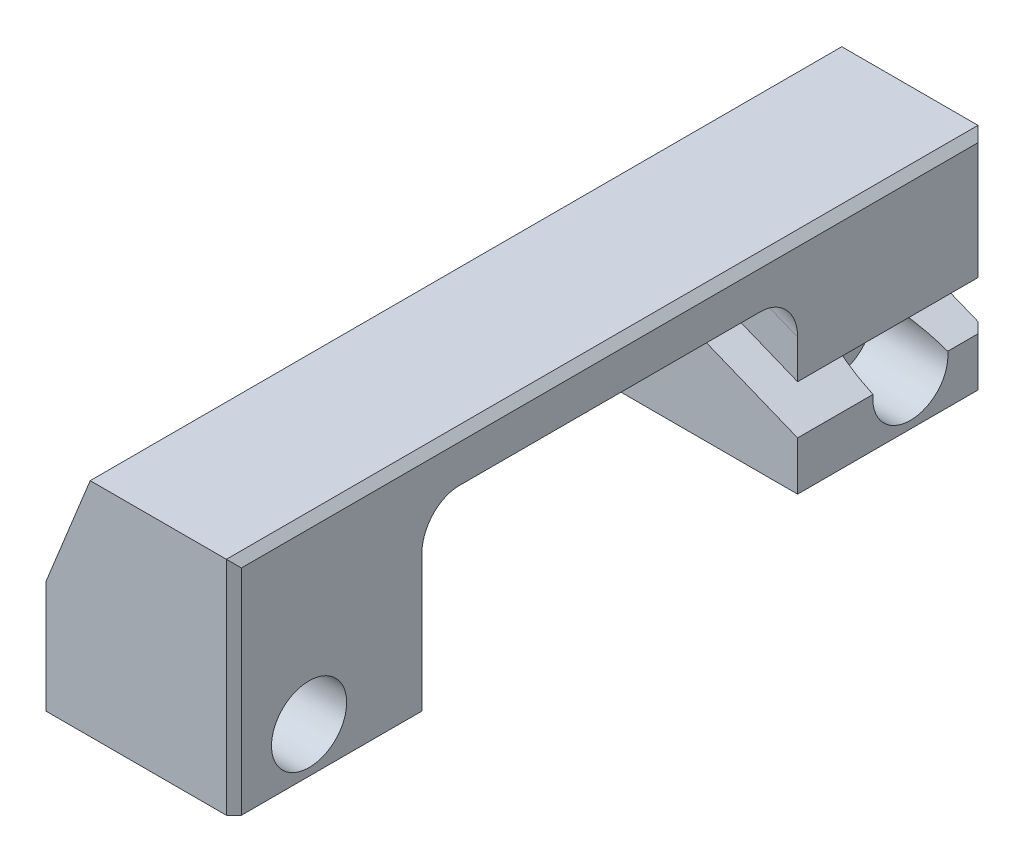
ISO-10303-21;
HEADER;
FILE_DESCRIPTION(('STEP AP214'),'2;1');
FILE_NAME('part.step','',(''),(''),'','','');
FILE_SCHEMA(('AUTOMOTIVE_DESIGN { 1 0 10303 214 1 1 1 1 }'));
ENDSEC;
DATA;
#1=APPLICATION_CONTEXT('core data for automotive mechanical design processes');
#2=APPLICATION_PROTOCOL_DEFINITION('international standard','automotive_design',2000,#1);
#3=PRODUCT_CONTEXT('',#1,'mechanical');
#4=PRODUCT('Part','Part','',(#3));
#5=PRODUCT_RELATED_PRODUCT_CATEGORY('part','',(#4));
#6=PRODUCT_DEFINITION_FORMATION('','',#4);
#7=PRODUCT_DEFINITION_CONTEXT('part definition',#1,'design');
#8=PRODUCT_DEFINITION('design','',#6,#7);
#9=PRODUCT_DEFINITION_SHAPE('','',#8);
#10=(LENGTH_UNIT() NAMED_UNIT(*) SI_UNIT(.MILLI.,.METRE.));
#11=(NAMED_UNIT(*) PLANE_ANGLE_UNIT() SI_UNIT($,.RADIAN.));
#12=(NAMED_UNIT(*) SI_UNIT($,.STERADIAN.) SOLID_ANGLE_UNIT());
#13=UNCERTAINTY_MEASURE_WITH_UNIT(LENGTH_MEASURE(1.E-05),#10,'distance_accuracy_value','');
#14=(GEOMETRIC_REPRESENTATION_CONTEXT(3) GLOBAL_UNCERTAINTY_ASSIGNED_CONTEXT((#13)) GLOBAL_UNIT_ASSIGNED_CONTEXT((#10,
#11,#12)) REPRESENTATION_CONTEXT('',''));
#15=CARTESIAN_POINT('',(0.,0.,0.));
#16=DIRECTION('',(0.,0.,1.));
#17=DIRECTION('',(1.,0.,0.));
#18=AXIS2_PLACEMENT_3D('',#15,#16,#17);
#19=CARTESIAN_POINT('',(0.,0.,50.));
#20=DIRECTION('',(0.,1.,0.));
#21=DIRECTION('',(0.,0.,1.));
#22=AXIS2_PLACEMENT_3D('',#19,#20,#21);
#23=PLANE('',#22);
#24=DIRECTION('',(1.,0.,0.));
#25=VECTOR('',#24,1.);
#26=CARTESIAN_POINT('',(0.,0.,50.));
#27=LINE('',#26,#25);
#28=CARTESIAN_POINT('',(7.00000000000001,0.,50.));
#29=VERTEX_POINT('',#28);
#30=CARTESIAN_POINT('',(31.,0.,50.));
#31=VERTEX_POINT('',#30);
#32=EDGE_CURVE('E509',#29,#31,#27,.T.);
#33=ORIENTED_EDGE('',*,*,#32,.F.);
#34=DIRECTION('',(0.,0.,1.));
#35=VECTOR('',#34,1.);
#36=CARTESIAN_POINT('',(7.,0.,-50.));
#37=LINE('',#36,#35);
#38=CARTESIAN_POINT('',(7.00000000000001,0.,25.));
#39=VERTEX_POINT('',#38);
#40=EDGE_CURVE('E494',#39,#29,#37,.T.);
#41=ORIENTED_EDGE('',*,*,#40,.F.);
#42=DIRECTION('',(1.,0.,0.));
#43=VECTOR('',#42,1.);
#44=CARTESIAN_POINT('',(6.35241145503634,0.,25.));
#45=LINE('',#44,#43);
#46=CARTESIAN_POINT('',(32.,0.,25.));
#47=VERTEX_POINT('',#46);
#48=EDGE_CURVE('E665',#39,#47,#45,.T.);
#49=ORIENTED_EDGE('',*,*,#48,.T.);
#50=DIRECTION('',(0.,0.,-1.));
#51=VECTOR('',#50,1.);
#52=CARTESIAN_POINT('',(32.,0.,50.));
#53=LINE('',#52,#51);
#54=CARTESIAN_POINT('',(32.,0.,49.));
#55=VERTEX_POINT('',#54);
#56=EDGE_CURVE('E531',#55,#47,#53,.T.);
#57=ORIENTED_EDGE('',*,*,#56,.F.);
#58=DIRECTION('',(0.707106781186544,0.,-0.707106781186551));
#59=VECTOR('',#58,1.);
#60=CARTESIAN_POINT('',(31.,0.,50.));
#61=LINE('',#60,#59);
#62=EDGE_CURVE('E516',#55,#31,#61,.F.);
#63=ORIENTED_EDGE('',*,*,#62,.T.);
#64=EDGE_LOOP('',(#33,#41,#49,#57,#63));
#65=FACE_BOUND('',#64,.T.);
#66=ADVANCED_FACE('F348',(#65),#23,.F.);
#67=CARTESIAN_POINT('',(32.,0.,50.));
#68=DIRECTION('',(-1.,0.,0.));
#69=DIRECTION('',(0.,0.,1.));
#70=AXIS2_PLACEMENT_3D('',#67,#68,#69);
#71=PLANE('',#70);
#72=CARTESIAN_POINT('',(32.,0.,-25.));
#73=VERTEX_POINT('',#72);
#74=CARTESIAN_POINT('',(32.,0.,-49.));
#75=VERTEX_POINT('',#74);
#76=EDGE_CURVE('E530',#73,#75,#53,.T.);
#77=ORIENTED_EDGE('',*,*,#76,.T.);
#78=DIRECTION('',(0.,1.,0.));
#79=VECTOR('',#78,1.);
#80=CARTESIAN_POINT('',(32.,6.48478614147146,-49.));
#81=LINE('',#80,#79);
#82=CARTESIAN_POINT('',(32.,6.48478614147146,-49.));
#83=VERTEX_POINT('',#82);
#84=EDGE_CURVE('E568',#75,#83,#81,.T.);
#85=ORIENTED_EDGE('',*,*,#84,.T.);
#86=DIRECTION('',(0.,0.,1.));
#87=VECTOR('',#86,1.);
#88=CARTESIAN_POINT('',(32.,6.48478614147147,-50.));
#89=LINE('',#88,#87);
#90=CARTESIAN_POINT('',(32.,6.48478614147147,-44.9764427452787));
#91=VERTEX_POINT('',#90);
#92=EDGE_CURVE('E690',#83,#91,#89,.T.);
#93=ORIENTED_EDGE('',*,*,#92,.T.);
#94=CARTESIAN_POINT('',(32.,6.,-40.));
#95=DIRECTION('',(1.,0.,0.));
#96=DIRECTION('',(0.,0.,-1.));
#97=AXIS2_PLACEMENT_3D('',#94,#95,#96);
#98=CIRCLE('',#97,4.99999999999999);
#99=CARTESIAN_POINT('',(32.,6.48478614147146,-35.0235572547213));
#100=VERTEX_POINT('',#99);
#101=EDGE_CURVE('E639',#100,#91,#98,.T.);
#102=ORIENTED_EDGE('',*,*,#101,.F.);
#103=CARTESIAN_POINT('',(32.,6.48478614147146,-25.));
#104=VERTEX_POINT('',#103);
#105=EDGE_CURVE('E697',#100,#104,#89,.T.);
#106=ORIENTED_EDGE('',*,*,#105,.T.);
#107=DIRECTION('',(0.,1.,0.));
#108=VECTOR('',#107,1.);
#109=CARTESIAN_POINT('',(32.,0.,-25.));
#110=LINE('',#109,#108);
#111=EDGE_CURVE('E678',#73,#104,#110,.T.);
#112=ORIENTED_EDGE('',*,*,#111,.F.);
#113=EDGE_LOOP('',(#77,#85,#93,#102,#106,#112));
#114=FACE_BOUND('',#113,.T.);
#115=ADVANCED_FACE('F748',(#114),#71,.F.);
#116=DIRECTION('',(1.,0.,0.));
#117=VECTOR('',#116,1.);
#118=CARTESIAN_POINT('',(6.35241145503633,0.,-25.));
#119=LINE('',#118,#117);
#120=CARTESIAN_POINT('',(7.,0.,-25.));
#121=VERTEX_POINT('',#120);
#122=EDGE_CURVE('E673',#121,#73,#119,.T.);
#123=ORIENTED_EDGE('',*,*,#122,.F.);
#124=CARTESIAN_POINT('',(7.,0.,-50.));
#125=VERTEX_POINT('',#124);
#126=EDGE_CURVE('E504',#125,#121,#37,.T.);
#127=ORIENTED_EDGE('',*,*,#126,.F.);
#128=DIRECTION('',(1.,0.,0.));
#129=VECTOR('',#128,1.);
#130=CARTESIAN_POINT('',(0.,0.,-50.));
#131=LINE('',#130,#129);
#132=CARTESIAN_POINT('',(31.,0.,-50.));
#133=VERTEX_POINT('',#132);
#134=EDGE_CURVE('E638',#125,#133,#131,.T.);
#135=ORIENTED_EDGE('',*,*,#134,.T.);
#136=DIRECTION('',(0.70710678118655,0.,0.707106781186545));
#137=VECTOR('',#136,1.);
#138=CARTESIAN_POINT('',(32.,0.,-49.));
#139=LINE('',#138,#137);
#140=EDGE_CURVE('E584',#133,#75,#139,.T.);
#141=ORIENTED_EDGE('',*,*,#140,.T.);
#142=ORIENTED_EDGE('',*,*,#76,.F.);
#143=EDGE_LOOP('',(#123,#127,#135,#141,#142));
#144=FACE_BOUND('',#143,.T.);
#145=ADVANCED_FACE('F350',(#144),#23,.F.);
#146=DIRECTION('',(0.,0.,1.));
#147=VECTOR('',#146,1.);
#148=CARTESIAN_POINT('',(32.,12.955994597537,-50.));
#149=LINE('',#148,#147);
#150=CARTESIAN_POINT('',(32.,12.955994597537,-49.));
#151=VERTEX_POINT('',#150);
#152=CARTESIAN_POINT('',(32.,12.955994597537,-25.));
#153=VERTEX_POINT('',#152);
#154=EDGE_CURVE('E600',#151,#153,#149,.T.);
#155=ORIENTED_EDGE('',*,*,#154,.F.);
#156=DIRECTION('',(0.,1.,0.));
#157=VECTOR('',#156,1.);
#158=CARTESIAN_POINT('',(32.,29.5,-49.));
#159=LINE('',#158,#157);
#160=CARTESIAN_POINT('',(32.,28.5,-49.));
#161=VERTEX_POINT('',#160);
#162=EDGE_CURVE('E590',#151,#161,#159,.T.);
#163=ORIENTED_EDGE('',*,*,#162,.T.);
#164=DIRECTION('',(0.,0.,1.));
#165=VECTOR('',#164,1.);
#166=CARTESIAN_POINT('',(32.,28.5,50.));
#167=LINE('',#166,#165);
#168=CARTESIAN_POINT('',(32.,28.5,49.));
#169=VERTEX_POINT('',#168);
#170=EDGE_CURVE('E586',#161,#169,#167,.T.);
#171=ORIENTED_EDGE('',*,*,#170,.T.);
#172=DIRECTION('',(0.,-1.,0.));
#173=VECTOR('',#172,1.);
#174=CARTESIAN_POINT('',(32.,0.,49.));
#175=LINE('',#174,#173);
#176=EDGE_CURVE('E588',#169,#55,#175,.T.);
#177=ORIENTED_EDGE('',*,*,#176,.T.);
#178=ORIENTED_EDGE('',*,*,#56,.T.);
#179=DIRECTION('',(0.,1.,0.));
#180=VECTOR('',#179,1.);
#181=CARTESIAN_POINT('',(32.,0.,25.));
#182=LINE('',#181,#180);
#183=CARTESIAN_POINT('',(32.,18.1073262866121,25.));
#184=VERTEX_POINT('',#183);
#185=EDGE_CURVE('E670',#47,#184,#182,.T.);
#186=ORIENTED_EDGE('',*,*,#185,.T.);
#187=CARTESIAN_POINT('',(32.,18.1073262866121,20.));
#188=DIRECTION('',(-1.,0.,0.));
#189=DIRECTION('',(0.,-1.,0.));
#190=AXIS2_PLACEMENT_3D('',#187,#188,#189);
#191=ELLIPSE('',#190,5.39267371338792,5.);
#192=CARTESIAN_POINT('',(32.,23.5,20.));
#193=VERTEX_POINT('',#192);
#194=EDGE_CURVE('E551',#184,#193,#191,.T.);
#195=ORIENTED_EDGE('',*,*,#194,.T.);
#196=DIRECTION('',(0.,0.,-1.));
#197=VECTOR('',#196,1.);
#198=CARTESIAN_POINT('',(32.,23.5,25.));
#199=LINE('',#198,#197);
#200=CARTESIAN_POINT('',(32.,23.5,-20.));
#201=VERTEX_POINT('',#200);
#202=EDGE_CURVE('E659',#193,#201,#199,.T.);
#203=ORIENTED_EDGE('',*,*,#202,.T.);
#204=CARTESIAN_POINT('',(32.,18.1073262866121,-20.));
#205=DIRECTION('',(-1.,0.,0.));
#206=DIRECTION('',(0.,1.,0.));
#207=AXIS2_PLACEMENT_3D('',#204,#205,#206);
#208=ELLIPSE('',#207,5.39267371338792,5.);
#209=CARTESIAN_POINT('',(32.,18.1073262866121,-25.));
#210=VERTEX_POINT('',#209);
#211=EDGE_CURVE('E548',#201,#210,#208,.T.);
#212=ORIENTED_EDGE('',*,*,#211,.T.);
#213=EDGE_CURVE('E609',#153,#210,#110,.T.);
#214=ORIENTED_EDGE('',*,*,#213,.F.);
#215=EDGE_LOOP('',(#155,#163,#171,#177,#178,#186,#195,#203,#212,#214));
#216=FACE_BOUND('',#215,.T.);
#217=CARTESIAN_POINT('',(32.,5.99999999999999,40.));
#218=DIRECTION('',(1.,0.,0.));
#219=DIRECTION('',(0.,0.,-1.));
#220=AXIS2_PLACEMENT_3D('',#217,#218,#219);
#221=CIRCLE('',#220,4.99999999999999);
#222=CARTESIAN_POINT('',(32.,5.99999999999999,35.));
#223=VERTEX_POINT('',#222);
#224=EDGE_CURVE('E650',#223,#223,#221,.T.);
#225=ORIENTED_EDGE('',*,*,#224,.F.);
#226=EDGE_LOOP('',(#225));
#227=FACE_BOUND('',#226,.T.);
#228=ADVANCED_FACE('F607',(#216,#227),#71,.F.);
#229=CARTESIAN_POINT('',(12.8785114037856,29.5,50.));
#230=DIRECTION('',(0.,-1.,0.));
#231=DIRECTION('',(0.,0.,-1.));
#232=AXIS2_PLACEMENT_3D('',#229,#230,#231);
#233=PLANE('',#232);
#234=DIRECTION('',(-1.,0.,0.));
#235=VECTOR('',#234,1.);
#236=CARTESIAN_POINT('',(12.8785114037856,29.5,50.));
#237=LINE('',#236,#235);
#238=CARTESIAN_POINT('',(31.,29.5,50.));
#239=VERTEX_POINT('',#238);
#240=CARTESIAN_POINT('',(12.8785114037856,29.5,50.));
#241=VERTEX_POINT('',#240);
#242=EDGE_CURVE('E517',#239,#241,#237,.T.);
#243=ORIENTED_EDGE('',*,*,#242,.F.);
#244=DIRECTION('',(0.,0.,-1.));
#245=VECTOR('',#244,1.);
#246=CARTESIAN_POINT('',(31.,29.5,50.));
#247=LINE('',#246,#245);
#248=CARTESIAN_POINT('',(31.,29.5,-50.));
#249=VERTEX_POINT('',#248);
#250=EDGE_CURVE('E11',#239,#249,#247,.T.);
#251=ORIENTED_EDGE('',*,*,#250,.T.);
#252=DIRECTION('',(-1.,0.,0.));
#253=VECTOR('',#252,1.);
#254=CARTESIAN_POINT('',(12.8785114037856,29.5,-50.));
#255=LINE('',#254,#253);
#256=CARTESIAN_POINT('',(12.8785114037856,29.5,-50.));
#257=VERTEX_POINT('',#256);
#258=EDGE_CURVE('E522',#249,#257,#255,.T.);
#259=ORIENTED_EDGE('',*,*,#258,.T.);
#260=DIRECTION('',(0.,0.,-1.));
#261=VECTOR('',#260,1.);
#262=CARTESIAN_POINT('',(12.8785114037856,29.5,50.));
#263=LINE('',#262,#261);
#264=EDGE_CURVE('E527',#241,#257,#263,.T.);
#265=ORIENTED_EDGE('',*,*,#264,.F.);
#266=EDGE_LOOP('',(#243,#251,#259,#265));
#267=FACE_BOUND('',#266,.T.);
#268=ADVANCED_FACE('F632',(#267),#233,.F.);
#269=CARTESIAN_POINT('',(5.00000000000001,10.,50.));
#270=DIRECTION('',(0.927183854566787,-0.374606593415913,0.));
#271=DIRECTION('',(0.374606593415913,0.927183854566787,0.));
#272=AXIS2_PLACEMENT_3D('',#269,#270,#271);
#273=PLANE('',#272);
#274=CARTESIAN_POINT('',(12.063255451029,27.4821707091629,-15.));
#275=DIRECTION('',(0.927183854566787,-0.374606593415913,0.));
#276=DIRECTION('',(0.374606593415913,0.927183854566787,0.));
#277=AXIS2_PLACEMENT_3D('',#274,#275,#276);
#278=CIRCLE('',#277,1.64999999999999);
#279=CARTESIAN_POINT('',(12.6813563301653,29.0120240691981,-15.));
#280=VERTEX_POINT('',#279);
#281=EDGE_CURVE('E569',#280,#280,#278,.T.);
#282=ORIENTED_EDGE('',*,*,#281,.T.);
#283=EDGE_LOOP('',(#282));
#284=FACE_BOUND('',#283,.T.);
#285=DIRECTION('',(-0.374606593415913,-0.927183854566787,0.));
#286=VECTOR('',#285,1.);
#287=CARTESIAN_POINT('',(4.99999999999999,10.,-50.));
#288=LINE('',#287,#286);
#289=CARTESIAN_POINT('',(7.,14.9501737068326,-50.));
#290=VERTEX_POINT('',#289);
#291=EDGE_CURVE('E518',#257,#290,#288,.T.);
#292=ORIENTED_EDGE('',*,*,#291,.T.);
#293=DIRECTION('',(0.,0.,1.));
#294=VECTOR('',#293,1.);
#295=CARTESIAN_POINT('',(7.00000000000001,14.9501737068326,50.));
#296=LINE('',#295,#294);
#297=CARTESIAN_POINT('',(7.,14.9501737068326,-6.90409228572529));
#298=VERTEX_POINT('',#297);
#299=EDGE_CURVE('E720',#290,#298,#296,.T.);
#300=ORIENTED_EDGE('',*,*,#299,.T.);
#301=CARTESIAN_POINT('',(8.69179611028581,19.1375160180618,0.));
#302=DIRECTION('',(0.927183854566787,-0.374606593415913,0.));
#303=DIRECTION('',(0.374606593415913,0.927183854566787,0.));
#304=AXIS2_PLACEMENT_3D('',#301,#302,#303);
#305=CIRCLE('',#304,8.25);
#306=CARTESIAN_POINT('',(7.,14.9501737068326,6.90409228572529));
#307=VERTEX_POINT('',#306);
#308=EDGE_CURVE('E681',#298,#307,#305,.T.);
#309=ORIENTED_EDGE('',*,*,#308,.T.);
#310=CARTESIAN_POINT('',(7.00000000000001,14.9501737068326,50.));
#311=VERTEX_POINT('',#310);
#312=EDGE_CURVE('E364',#307,#311,#296,.T.);
#313=ORIENTED_EDGE('',*,*,#312,.T.);
#314=DIRECTION('',(-0.374606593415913,-0.927183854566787,0.));
#315=VECTOR('',#314,1.);
#316=CARTESIAN_POINT('',(5.00000000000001,10.,50.));
#317=LINE('',#316,#315);
#318=EDGE_CURVE('E512',#241,#311,#317,.T.);
#319=ORIENTED_EDGE('',*,*,#318,.F.);
#320=ORIENTED_EDGE('',*,*,#264,.T.);
#321=EDGE_LOOP('',(#292,#300,#309,#313,#319,#320));
#322=FACE_BOUND('',#321,.T.);
#323=ADVANCED_FACE('F728',(#284,#322),#273,.F.);
#324=CARTESIAN_POINT('',(0.,10.,50.));
#325=DIRECTION('',(0.,0.,-1.));
#326=DIRECTION('',(-1.,0.,0.));
#327=AXIS2_PLACEMENT_3D('',#324,#325,#326);
#328=PLANE('',#327);
#329=ORIENTED_EDGE('',*,*,#318,.T.);
#330=DIRECTION('',(0.,1.,0.));
#331=VECTOR('',#330,1.);
#332=CARTESIAN_POINT('',(7.,29.5,50.));
#333=LINE('',#332,#331);
#334=EDGE_CURVE('E498',#29,#311,#333,.T.);
#335=ORIENTED_EDGE('',*,*,#334,.F.);
#336=ORIENTED_EDGE('',*,*,#32,.T.);
#337=DIRECTION('',(0.,1.,0.));
#338=VECTOR('',#337,1.);
#339=CARTESIAN_POINT('',(31.,10.,50.));
#340=LINE('',#339,#338);
#341=EDGE_CURVE('E357',#31,#239,#340,.T.);
#342=ORIENTED_EDGE('',*,*,#341,.T.);
#343=ORIENTED_EDGE('',*,*,#242,.T.);
#344=EDGE_LOOP('',(#329,#335,#336,#342,#343));
#345=FACE_BOUND('',#344,.T.);
#346=ADVANCED_FACE('F508',(#345),#328,.F.);
#347=CARTESIAN_POINT('',(0.,10.,-50.));
#348=DIRECTION('',(0.,0.,-1.));
#349=DIRECTION('',(-1.,0.,0.));
#350=AXIS2_PLACEMENT_3D('',#347,#348,#349);
#351=PLANE('',#350);
#352=DIRECTION('',(0.,1.,0.));
#353=VECTOR('',#352,1.);
#354=CARTESIAN_POINT('',(6.99999999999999,29.5,-50.));
#355=LINE('',#354,#353);
#356=EDGE_CURVE('E505',#125,#290,#355,.T.);
#357=ORIENTED_EDGE('',*,*,#356,.T.);
#358=ORIENTED_EDGE('',*,*,#291,.F.);
#359=ORIENTED_EDGE('',*,*,#258,.F.);
#360=DIRECTION('',(0.,-1.,0.));
#361=VECTOR('',#360,1.);
#362=CARTESIAN_POINT('',(31.,12.955994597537,-50.));
#363=LINE('',#362,#361);
#364=CARTESIAN_POINT('',(31.,13.3600208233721,-50.));
#365=VERTEX_POINT('',#364);
#366=EDGE_CURVE('E578',#249,#365,#363,.T.);
#367=ORIENTED_EDGE('',*,*,#366,.T.);
#368=DIRECTION('',(-0.927183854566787,0.374606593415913,0.));
#369=VECTOR('',#368,1.);
#370=CARTESIAN_POINT('',(20.941822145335,17.4237884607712,-50.));
#371=LINE('',#370,#369);
#372=CARTESIAN_POINT('',(20.941822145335,17.4237884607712,-50.));
#373=VERTEX_POINT('',#372);
#374=EDGE_CURVE('E572',#365,#373,#371,.T.);
#375=ORIENTED_EDGE('',*,*,#374,.T.);
#376=DIRECTION('',(-0.374606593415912,-0.927183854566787,0.));
#377=VECTOR('',#376,1.);
#378=CARTESIAN_POINT('',(20.941822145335,17.4237884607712,-50.));
#379=LINE('',#378,#377);
#380=CARTESIAN_POINT('',(18.6941825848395,11.8606853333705,-50.));
#381=VERTEX_POINT('',#380);
#382=EDGE_CURVE('E701',#373,#381,#379,.T.);
#383=ORIENTED_EDGE('',*,*,#382,.T.);
#384=DIRECTION('',(0.927183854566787,-0.374606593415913,0.));
#385=VECTOR('',#384,1.);
#386=CARTESIAN_POINT('',(18.6941825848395,11.8606853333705,-50.));
#387=LINE('',#386,#385);
#388=CARTESIAN_POINT('',(31.,6.88881236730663,-50.));
#389=VERTEX_POINT('',#388);
#390=EDGE_CURVE('E611',#381,#389,#387,.T.);
#391=ORIENTED_EDGE('',*,*,#390,.T.);
#392=DIRECTION('',(0.,-1.,0.));
#393=VECTOR('',#392,1.);
#394=CARTESIAN_POINT('',(31.,0.,-50.));
#395=LINE('',#394,#393);
#396=EDGE_CURVE('E580',#389,#133,#395,.T.);
#397=ORIENTED_EDGE('',*,*,#396,.T.);
#398=ORIENTED_EDGE('',*,*,#134,.F.);
#399=EDGE_LOOP('',(#357,#358,#359,#367,#375,#383,#391,#397,#398));
#400=FACE_BOUND('',#399,.T.);
#401=ADVANCED_FACE('F637',(#400),#351,.T.);
#402=CARTESIAN_POINT('',(32.,6.,-40.));
#403=DIRECTION('',(1.,0.,0.));
#404=DIRECTION('',(0.,0.,-1.));
#405=AXIS2_PLACEMENT_3D('',#402,#403,#404);
#406=CYLINDRICAL_SURFACE('',#405,2.64999999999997);
#407=CARTESIAN_POINT('',(7.,6.00000000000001,-40.));
#408=DIRECTION('',(1.,0.,0.));
#409=DIRECTION('',(0.,1.,0.));
#410=AXIS2_PLACEMENT_3D('',#407,#408,#409);
#411=CIRCLE('',#410,2.64999999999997);
#412=CARTESIAN_POINT('',(7.,8.64999999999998,-40.));
#413=VERTEX_POINT('',#412);
#414=EDGE_CURVE('E620',#413,#413,#411,.F.);
#415=ORIENTED_EDGE('',*,*,#414,.T.);
#416=EDGE_LOOP('',(#415));
#417=FACE_BOUND('',#416,.T.);
#418=CARTESIAN_POINT('',(22.,6.00000000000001,-40.));
#419=DIRECTION('',(1.,0.,0.));
#420=DIRECTION('',(0.,0.,-1.));
#421=AXIS2_PLACEMENT_3D('',#418,#419,#420);
#422=CIRCLE('',#421,2.64999999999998);
#423=CARTESIAN_POINT('',(22.,6.00000000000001,-42.65));
#424=VERTEX_POINT('',#423);
#425=EDGE_CURVE('E647',#424,#424,#422,.T.);
#426=ORIENTED_EDGE('',*,*,#425,.T.);
#427=EDGE_LOOP('',(#426));
#428=FACE_BOUND('',#427,.T.);
#429=ADVANCED_FACE('F836',(#417,#428),#406,.F.);
#430=CARTESIAN_POINT('',(32.,6.,-40.));
#431=DIRECTION('',(1.,0.,0.));
#432=DIRECTION('',(0.,0.,-1.));
#433=AXIS2_PLACEMENT_3D('',#430,#431,#432);
#434=CYLINDRICAL_SURFACE('',#433,5.);
#435=ORIENTED_EDGE('',*,*,#101,.T.);
#436=CARTESIAN_POINT('',(33.1998878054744,6.,-40.));
#437=DIRECTION('',(-0.374606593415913,-0.927183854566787,0.));
#438=DIRECTION('',(0.927183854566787,-0.374606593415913,0.));
#439=AXIS2_PLACEMENT_3D('',#436,#437,#438);
#440=ELLIPSE('',#439,13.34733581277,5.);
#441=CARTESIAN_POINT('',(22.,10.525048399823,-42.1269548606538));
#442=VERTEX_POINT('',#441);
#443=EDGE_CURVE('E684',#91,#442,#440,.F.);
#444=ORIENTED_EDGE('',*,*,#443,.T.);
#445=CARTESIAN_POINT('',(22.,6.00000000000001,-40.));
#446=DIRECTION('',(1.,0.,0.));
#447=DIRECTION('',(0.,0.,-1.));
#448=AXIS2_PLACEMENT_3D('',#445,#446,#447);
#449=CIRCLE('',#448,5.);
#450=CARTESIAN_POINT('',(22.,10.525048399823,-37.8730451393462));
#451=VERTEX_POINT('',#450);
#452=EDGE_CURVE('E644',#451,#442,#449,.T.);
#453=ORIENTED_EDGE('',*,*,#452,.F.);
#454=EDGE_CURVE('E685',#451,#100,#440,.F.);
#455=ORIENTED_EDGE('',*,*,#454,.T.);
#456=EDGE_LOOP('',(#435,#444,#453,#455));
#457=FACE_BOUND('',#456,.T.);
#458=ADVANCED_FACE('F771',(#457),#434,.F.);
#459=CARTESIAN_POINT('',(22.,8.64999999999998,-40.));
#460=DIRECTION('',(-1.,0.,0.));
#461=DIRECTION('',(0.,0.,1.));
#462=AXIS2_PLACEMENT_3D('',#459,#460,#461);
#463=PLANE('',#462);
#464=ORIENTED_EDGE('',*,*,#425,.F.);
#465=EDGE_LOOP('',(#464));
#466=FACE_BOUND('',#465,.T.);
#467=ORIENTED_EDGE('',*,*,#452,.T.);
#468=DIRECTION('',(0.,0.,1.));
#469=VECTOR('',#468,1.);
#470=CARTESIAN_POINT('',(22.,10.525048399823,-40.));
#471=LINE('',#470,#469);
#472=EDGE_CURVE('E688',#442,#451,#471,.T.);
#473=ORIENTED_EDGE('',*,*,#472,.T.);
#474=EDGE_LOOP('',(#467,#473));
#475=FACE_BOUND('',#474,.T.);
#476=ADVANCED_FACE('F775',(#466,#475),#463,.F.);
#477=CARTESIAN_POINT('',(32.,5.99999999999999,40.));
#478=DIRECTION('',(1.,0.,0.));
#479=DIRECTION('',(0.,0.,-1.));
#480=AXIS2_PLACEMENT_3D('',#477,#478,#479);
#481=CYLINDRICAL_SURFACE('',#480,2.64999999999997);
#482=CARTESIAN_POINT('',(7.00000000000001,5.99999999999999,40.));
#483=DIRECTION('',(1.,0.,0.));
#484=DIRECTION('',(0.,1.,0.));
#485=AXIS2_PLACEMENT_3D('',#482,#483,#484);
#486=CIRCLE('',#485,2.64999999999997);
#487=CARTESIAN_POINT('',(7.00000000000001,8.64999999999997,40.));
#488=VERTEX_POINT('',#487);
#489=EDGE_CURVE('E711',#488,#488,#486,.F.);
#490=ORIENTED_EDGE('',*,*,#489,.T.);
#491=EDGE_LOOP('',(#490));
#492=FACE_BOUND('',#491,.T.);
#493=CARTESIAN_POINT('',(22.,5.99999999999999,40.));
#494=DIRECTION('',(1.,0.,0.));
#495=DIRECTION('',(0.,0.,-1.));
#496=AXIS2_PLACEMENT_3D('',#493,#494,#495);
#497=CIRCLE('',#496,2.64999999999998);
#498=CARTESIAN_POINT('',(22.,5.99999999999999,37.35));
#499=VERTEX_POINT('',#498);
#500=EDGE_CURVE('E656',#499,#499,#497,.T.);
#501=ORIENTED_EDGE('',*,*,#500,.T.);
#502=EDGE_LOOP('',(#501));
#503=FACE_BOUND('',#502,.T.);
#504=ADVANCED_FACE('F815',(#492,#503),#481,.F.);
#505=CARTESIAN_POINT('',(32.,5.99999999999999,40.));
#506=DIRECTION('',(1.,0.,0.));
#507=DIRECTION('',(0.,0.,-1.));
#508=AXIS2_PLACEMENT_3D('',#505,#506,#507);
#509=CYLINDRICAL_SURFACE('',#508,5.);
#510=CARTESIAN_POINT('',(22.,5.99999999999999,40.));
#511=DIRECTION('',(1.,0.,0.));
#512=DIRECTION('',(0.,0.,-1.));
#513=AXIS2_PLACEMENT_3D('',#510,#511,#512);
#514=CIRCLE('',#513,5.);
#515=CARTESIAN_POINT('',(22.,6.,35.));
#516=VERTEX_POINT('',#515);
#517=EDGE_CURVE('E653',#516,#516,#514,.T.);
#518=ORIENTED_EDGE('',*,*,#517,.F.);
#519=EDGE_LOOP('',(#518));
#520=FACE_BOUND('',#519,.T.);
#521=ORIENTED_EDGE('',*,*,#224,.T.);
#522=EDGE_LOOP('',(#521));
#523=FACE_BOUND('',#522,.T.);
#524=ADVANCED_FACE('F818',(#520,#523),#509,.F.);
#525=CARTESIAN_POINT('',(22.,8.64999999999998,40.));
#526=DIRECTION('',(-1.,0.,0.));
#527=DIRECTION('',(0.,0.,1.));
#528=AXIS2_PLACEMENT_3D('',#525,#526,#527);
#529=PLANE('',#528);
#530=ORIENTED_EDGE('',*,*,#500,.F.);
#531=EDGE_LOOP('',(#530));
#532=FACE_BOUND('',#531,.T.);
#533=ORIENTED_EDGE('',*,*,#517,.T.);
#534=EDGE_LOOP('',(#533));
#535=FACE_BOUND('',#534,.T.);
#536=ADVANCED_FACE('F822',(#532,#535),#529,.F.);
#537=CARTESIAN_POINT('',(18.1137759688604,29.1103986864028,25.));
#538=DIRECTION('',(-0.374606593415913,-0.927183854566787,0.));
#539=DIRECTION('',(0.927183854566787,-0.374606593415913,0.));
#540=AXIS2_PLACEMENT_3D('',#537,#538,#539);
#541=PLANE('',#540);
#542=DIRECTION('',(0.,0.,-1.));
#543=VECTOR('',#542,1.);
#544=CARTESIAN_POINT('',(18.1137759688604,29.1103986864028,25.));
#545=LINE('',#544,#543);
#546=CARTESIAN_POINT('',(18.1137759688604,29.1103986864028,20.));
#547=VERTEX_POINT('',#546);
#548=CARTESIAN_POINT('',(18.1137759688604,29.1103986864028,-20.));
#549=VERTEX_POINT('',#548);
#550=EDGE_CURVE('E662',#547,#549,#545,.T.);
#551=ORIENTED_EDGE('',*,*,#550,.T.);
#552=DIRECTION('',(-0.927183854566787,0.374606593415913,0.));
#553=VECTOR('',#552,1.);
#554=CARTESIAN_POINT('',(18.1137759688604,29.1103986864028,-20.));
#555=LINE('',#554,#553);
#556=EDGE_CURVE('E544',#549,#201,#555,.F.);
#557=ORIENTED_EDGE('',*,*,#556,.T.);
#558=ORIENTED_EDGE('',*,*,#202,.F.);
#559=DIRECTION('',(-0.927183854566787,0.374606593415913,0.));
#560=VECTOR('',#559,1.);
#561=CARTESIAN_POINT('',(18.1137759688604,29.1103986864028,20.));
#562=LINE('',#561,#560);
#563=EDGE_CURVE('E541',#193,#547,#562,.T.);
#564=ORIENTED_EDGE('',*,*,#563,.T.);
#565=EDGE_LOOP('',(#551,#557,#558,#564));
#566=FACE_BOUND('',#565,.T.);
#567=ADVANCED_FACE('F825',(#566),#541,.T.);
#568=CARTESIAN_POINT('',(18.1137759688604,29.1103986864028,25.));
#569=DIRECTION('',(0.927183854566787,-0.374606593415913,0.));
#570=DIRECTION('',(0.374606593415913,0.927183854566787,0.));
#571=AXIS2_PLACEMENT_3D('',#568,#569,#570);
#572=PLANE('',#571);
#573=DIRECTION('',(0.,0.,1.));
#574=VECTOR('',#573,1.);
#575=CARTESIAN_POINT('',(7.00000000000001,1.60283789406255,25.));
#576=LINE('',#575,#574);
#577=CARTESIAN_POINT('',(7.,1.60283789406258,-25.));
#578=VERTEX_POINT('',#577);
#579=CARTESIAN_POINT('',(7.00000000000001,1.60283789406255,25.));
#580=VERTEX_POINT('',#579);
#581=EDGE_CURVE('E715',#578,#580,#576,.T.);
#582=ORIENTED_EDGE('',*,*,#581,.F.);
#583=DIRECTION('',(-0.374606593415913,-0.927183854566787,0.));
#584=VECTOR('',#583,1.);
#585=CARTESIAN_POINT('',(18.1137759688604,29.1103986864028,-25.));
#586=LINE('',#585,#584);
#587=CARTESIAN_POINT('',(16.2407430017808,24.4744794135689,-25.));
#588=VERTEX_POINT('',#587);
#589=EDGE_CURVE('E675',#588,#578,#586,.T.);
#590=ORIENTED_EDGE('',*,*,#589,.F.);
#591=CARTESIAN_POINT('',(16.2407430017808,24.4744794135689,-20.));
#592=DIRECTION('',(0.927183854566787,-0.374606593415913,0.));
#593=DIRECTION('',(0.374606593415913,0.927183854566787,0.));
#594=AXIS2_PLACEMENT_3D('',#591,#592,#593);
#595=CIRCLE('',#594,5.);
#596=EDGE_CURVE('E539',#588,#549,#595,.T.);
#597=ORIENTED_EDGE('',*,*,#596,.T.);
#598=ORIENTED_EDGE('',*,*,#550,.F.);
#599=CARTESIAN_POINT('',(16.2407430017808,24.4744794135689,20.));
#600=DIRECTION('',(0.927183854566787,-0.374606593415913,0.));
#601=DIRECTION('',(0.374606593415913,0.927183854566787,0.));
#602=AXIS2_PLACEMENT_3D('',#599,#600,#601);
#603=CIRCLE('',#602,5.);
#604=CARTESIAN_POINT('',(16.2407430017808,24.4744794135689,25.));
#605=VERTEX_POINT('',#604);
#606=EDGE_CURVE('E537',#547,#605,#603,.T.);
#607=ORIENTED_EDGE('',*,*,#606,.T.);
#608=DIRECTION('',(-0.374606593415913,-0.927183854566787,0.));
#609=VECTOR('',#608,1.);
#610=CARTESIAN_POINT('',(18.1137759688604,29.1103986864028,25.));
#611=LINE('',#610,#609);
#612=EDGE_CURVE('E667',#605,#580,#611,.T.);
#613=ORIENTED_EDGE('',*,*,#612,.T.);
#614=EDGE_LOOP('',(#582,#590,#597,#598,#607,#613));
#615=FACE_BOUND('',#614,.T.);
#616=CARTESIAN_POINT('',(9.95625604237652,8.91982835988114,-15.));
#617=DIRECTION('',(0.927183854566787,-0.374606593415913,0.));
#618=DIRECTION('',(0.374606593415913,0.927183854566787,0.));
#619=AXIS2_PLACEMENT_3D('',#616,#617,#618);
#620=CIRCLE('',#619,1.64999999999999);
#621=CARTESIAN_POINT('',(10.5743569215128,10.4496817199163,-15.));
#622=VERTEX_POINT('',#621);
#623=EDGE_CURVE('E628',#622,#622,#620,.T.);
#624=ORIENTED_EDGE('',*,*,#623,.F.);
#625=EDGE_LOOP('',(#624));
#626=FACE_BOUND('',#625,.T.);
#627=CARTESIAN_POINT('',(16.6991747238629,25.6091377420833,-15.));
#628=DIRECTION('',(0.927183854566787,-0.374606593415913,0.));
#629=DIRECTION('',(0.374606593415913,0.927183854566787,0.));
#630=AXIS2_PLACEMENT_3D('',#627,#628,#629);
#631=CIRCLE('',#630,1.64999999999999);
#632=CARTESIAN_POINT('',(17.3172756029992,27.1389911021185,-15.));
#633=VERTEX_POINT('',#632);
#634=EDGE_CURVE('E573',#633,#633,#631,.T.);
#635=ORIENTED_EDGE('',*,*,#634,.F.);
#636=EDGE_LOOP('',(#635));
#637=FACE_BOUND('',#636,.T.);
#638=CARTESIAN_POINT('',(13.3277153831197,17.2644830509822,0.));
#639=DIRECTION('',(0.927183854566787,-0.374606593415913,0.));
#640=DIRECTION('',(0.374606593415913,0.927183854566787,0.));
#641=AXIS2_PLACEMENT_3D('',#638,#639,#640);
#642=CIRCLE('',#641,8.75);
#643=CARTESIAN_POINT('',(16.605523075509,25.3773417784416,0.));
#644=VERTEX_POINT('',#643);
#645=EDGE_CURVE('E556',#644,#644,#642,.F.);
#646=ORIENTED_EDGE('',*,*,#645,.T.);
#647=EDGE_LOOP('',(#646));
#648=FACE_BOUND('',#647,.T.);
#649=ADVANCED_FACE('F898',(#615,#626,#637,#648),#572,.T.);
#650=CARTESIAN_POINT('',(32.,0.,25.));
#651=DIRECTION('',(0.,0.,-1.));
#652=DIRECTION('',(-1.,0.,0.));
#653=AXIS2_PLACEMENT_3D('',#650,#651,#652);
#654=PLANE('',#653);
#655=DIRECTION('',(0.,-1.,0.));
#656=VECTOR('',#655,1.);
#657=CARTESIAN_POINT('',(7.00000000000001,0.,25.));
#658=LINE('',#657,#656);
#659=EDGE_CURVE('E500',#580,#39,#658,.T.);
#660=ORIENTED_EDGE('',*,*,#659,.F.);
#661=ORIENTED_EDGE('',*,*,#612,.F.);
#662=DIRECTION('',(-0.927183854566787,0.374606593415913,0.));
#663=VECTOR('',#662,1.);
#664=CARTESIAN_POINT('',(30.1269670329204,18.8640807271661,25.));
#665=LINE('',#664,#663);
#666=EDGE_CURVE('E546',#605,#184,#665,.F.);
#667=ORIENTED_EDGE('',*,*,#666,.T.);
#668=ORIENTED_EDGE('',*,*,#185,.F.);
#669=ORIENTED_EDGE('',*,*,#48,.F.);
#670=EDGE_LOOP('',(#660,#661,#667,#668,#669));
#671=FACE_BOUND('',#670,.T.);
#672=ADVANCED_FACE('F906',(#671),#654,.T.);
#673=CARTESIAN_POINT('',(32.,0.,-25.));
#674=DIRECTION('',(0.,0.,-1.));
#675=DIRECTION('',(-1.,0.,0.));
#676=AXIS2_PLACEMENT_3D('',#673,#674,#675);
#677=PLANE('',#676);
#678=ORIENTED_EDGE('',*,*,#589,.T.);
#679=DIRECTION('',(0.,-1.,0.));
#680=VECTOR('',#679,1.);
#681=CARTESIAN_POINT('',(7.,0.,-25.));
#682=LINE('',#681,#680);
#683=EDGE_CURVE('E717',#578,#121,#682,.T.);
#684=ORIENTED_EDGE('',*,*,#683,.T.);
#685=ORIENTED_EDGE('',*,*,#122,.T.);
#686=ORIENTED_EDGE('',*,*,#111,.T.);
#687=DIRECTION('',(-0.927183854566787,0.374606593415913,0.));
#688=VECTOR('',#687,1.);
#689=CARTESIAN_POINT('',(34.2523554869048,5.5747754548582,-25.));
#690=LINE('',#689,#688);
#691=CARTESIAN_POINT('',(18.6941825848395,11.8606853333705,-25.));
#692=VERTEX_POINT('',#691);
#693=EDGE_CURVE('E565',#104,#692,#690,.T.);
#694=ORIENTED_EDGE('',*,*,#693,.T.);
#695=DIRECTION('',(0.374606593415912,0.927183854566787,0.));
#696=VECTOR('',#695,1.);
#697=CARTESIAN_POINT('',(16.4418270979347,6.28590987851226,-25.));
#698=LINE('',#697,#696);
#699=CARTESIAN_POINT('',(20.941822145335,17.4237884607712,-25.));
#700=VERTEX_POINT('',#699);
#701=EDGE_CURVE('E562',#692,#700,#698,.T.);
#702=ORIENTED_EDGE('',*,*,#701,.T.);
#703=DIRECTION('',(0.927183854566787,-0.374606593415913,0.));
#704=VECTOR('',#703,1.);
#705=CARTESIAN_POINT('',(36.4999950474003,11.1378785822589,-25.));
#706=LINE('',#705,#704);
#707=EDGE_CURVE('E559',#700,#153,#706,.T.);
#708=ORIENTED_EDGE('',*,*,#707,.T.);
#709=ORIENTED_EDGE('',*,*,#213,.T.);
#710=DIRECTION('',(-0.927183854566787,0.374606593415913,0.));
#711=VECTOR('',#710,1.);
#712=CARTESIAN_POINT('',(38.2892028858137,15.5663233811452,-25.));
#713=LINE('',#712,#711);
#714=EDGE_CURVE('E534',#210,#588,#713,.T.);
#715=ORIENTED_EDGE('',*,*,#714,.T.);
#716=EDGE_LOOP('',(#678,#684,#685,#686,#694,#702,#708,#709,#715));
#717=FACE_BOUND('',#716,.T.);
#718=ADVANCED_FACE('F763',(#717),#677,.F.);
#719=CARTESIAN_POINT('',(38.2892028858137,15.5663233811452,-20.));
#720=DIRECTION('',(-0.927183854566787,0.374606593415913,0.));
#721=DIRECTION('',(-0.374606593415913,-0.927183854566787,0.));
#722=AXIS2_PLACEMENT_3D('',#719,#720,#721);
#723=CYLINDRICAL_SURFACE('',#722,5.);
#724=ORIENTED_EDGE('',*,*,#211,.F.);
#725=ORIENTED_EDGE('',*,*,#556,.F.);
#726=ORIENTED_EDGE('',*,*,#596,.F.);
#727=ORIENTED_EDGE('',*,*,#714,.F.);
#728=EDGE_LOOP('',(#724,#725,#726,#727));
#729=FACE_BOUND('',#728,.T.);
#730=ADVANCED_FACE('F744',(#729),#723,.F.);
#731=CARTESIAN_POINT('',(16.2407430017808,24.4744794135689,20.));
#732=DIRECTION('',(0.927183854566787,-0.374606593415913,0.));
#733=DIRECTION('',(0.374606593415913,0.927183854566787,0.));
#734=AXIS2_PLACEMENT_3D('',#731,#732,#733);
#735=CYLINDRICAL_SURFACE('',#734,5.);
#736=ORIENTED_EDGE('',*,*,#194,.F.);
#737=ORIENTED_EDGE('',*,*,#666,.F.);
#738=ORIENTED_EDGE('',*,*,#606,.F.);
#739=ORIENTED_EDGE('',*,*,#563,.F.);
#740=EDGE_LOOP('',(#736,#737,#738,#739));
#741=FACE_BOUND('',#740,.T.);
#742=ADVANCED_FACE('F734',(#741),#735,.F.);
#743=CARTESIAN_POINT('',(-2.37947250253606,23.6105988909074,0.));
#744=DIRECTION('',(0.927183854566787,-0.374606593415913,0.));
#745=DIRECTION('',(0.374606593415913,0.927183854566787,0.));
#746=AXIS2_PLACEMENT_3D('',#743,#744,#745);
#747=CYLINDRICAL_SURFACE('',#746,8.25);
#748=CARTESIAN_POINT('',(12.8641234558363,17.4517863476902,0.));
#749=DIRECTION('',(0.927183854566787,-0.374606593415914,0.));
#750=DIRECTION('',(0.374606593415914,0.927183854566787,0.));
#751=AXIS2_PLACEMENT_3D('',#748,#749,#750);
#752=CIRCLE('',#751,8.25);
#753=CARTESIAN_POINT('',(15.9546278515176,25.1010531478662,0.));
#754=VERTEX_POINT('',#753);
#755=EDGE_CURVE('E553',#754,#754,#752,.T.);
#756=ORIENTED_EDGE('',*,*,#755,.T.);
#757=EDGE_LOOP('',(#756));
#758=FACE_BOUND('',#757,.T.);
#759=ORIENTED_EDGE('',*,*,#308,.F.);
#760=CARTESIAN_POINT('',(7.,19.8210460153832,0.));
#761=DIRECTION('',(1.,0.,0.));
#762=DIRECTION('',(0.,-1.,0.));
#763=AXIS2_PLACEMENT_3D('',#760,#761,#762);
#764=ELLIPSE('',#763,8.89791162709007,8.25);
#765=EDGE_CURVE('E722',#298,#307,#764,.F.);
#766=ORIENTED_EDGE('',*,*,#765,.T.);
#767=EDGE_LOOP('',(#759,#766));
#768=FACE_BOUND('',#767,.T.);
#769=ADVANCED_FACE('F731',(#758,#768),#747,.F.);
#770=CARTESIAN_POINT('',(12.8641234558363,17.4517863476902,0.));
#771=DIRECTION('',(0.927183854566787,-0.374606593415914,0.));
#772=DIRECTION('',(0.374606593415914,0.927183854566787,0.));
#773=AXIS2_PLACEMENT_3D('',#770,#771,#772);
#774=CONICAL_SURFACE('',#773,8.25,0.78539816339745);
#775=ORIENTED_EDGE('',*,*,#645,.F.);
#776=EDGE_LOOP('',(#775));
#777=FACE_BOUND('',#776,.T.);
#778=ORIENTED_EDGE('',*,*,#755,.F.);
#779=EDGE_LOOP('',(#778));
#780=FACE_BOUND('',#779,.T.);
#781=ADVANCED_FACE('F733',(#777,#780),#774,.F.);
#782=CARTESIAN_POINT('',(18.6941825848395,11.8606853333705,-50.));
#783=DIRECTION('',(-0.374606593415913,-0.927183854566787,0.));
#784=DIRECTION('',(0.927183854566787,-0.374606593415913,0.));
#785=AXIS2_PLACEMENT_3D('',#782,#783,#784);
#786=PLANE('',#785);
#787=ORIENTED_EDGE('',*,*,#92,.F.);
#788=DIRECTION('',(-0.679904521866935,0.274699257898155,-0.67990452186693));
#789=VECTOR('',#788,1.);
#790=CARTESIAN_POINT('',(33.2111587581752,5.99544623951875,-47.7888412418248));
#791=LINE('',#790,#789);
#792=EDGE_CURVE('E576',#83,#389,#791,.T.);
#793=ORIENTED_EDGE('',*,*,#792,.T.);
#794=ORIENTED_EDGE('',*,*,#390,.F.);
#795=DIRECTION('',(0.,0.,1.));
#796=VECTOR('',#795,1.);
#797=CARTESIAN_POINT('',(18.6941825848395,11.8606853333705,-50.));
#798=LINE('',#797,#796);
#799=EDGE_CURVE('E694',#381,#692,#798,.T.);
#800=ORIENTED_EDGE('',*,*,#799,.T.);
#801=ORIENTED_EDGE('',*,*,#693,.F.);
#802=ORIENTED_EDGE('',*,*,#105,.F.);
#803=ORIENTED_EDGE('',*,*,#454,.F.);
#804=ORIENTED_EDGE('',*,*,#472,.F.);
#805=ORIENTED_EDGE('',*,*,#443,.F.);
#806=EDGE_LOOP('',(#787,#793,#794,#800,#801,#802,#803,#804,#805));
#807=FACE_BOUND('',#806,.T.);
#808=ADVANCED_FACE('F741',(#807),#786,.F.);
#809=CARTESIAN_POINT('',(20.941822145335,17.4237884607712,-50.));
#810=DIRECTION('',(-0.927183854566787,0.374606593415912,0.));
#811=DIRECTION('',(-0.374606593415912,-0.927183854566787,0.));
#812=AXIS2_PLACEMENT_3D('',#809,#810,#811);
#813=PLANE('',#812);
#814=ORIENTED_EDGE('',*,*,#799,.F.);
#815=ORIENTED_EDGE('',*,*,#382,.F.);
#816=DIRECTION('',(0.,0.,1.));
#817=VECTOR('',#816,1.);
#818=CARTESIAN_POINT('',(20.941822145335,17.4237884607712,-50.));
#819=LINE('',#818,#817);
#820=EDGE_CURVE('E610',#373,#700,#819,.T.);
#821=ORIENTED_EDGE('',*,*,#820,.T.);
#822=ORIENTED_EDGE('',*,*,#701,.F.);
#823=EDGE_LOOP('',(#814,#815,#821,#822));
#824=FACE_BOUND('',#823,.T.);
#825=ADVANCED_FACE('F783',(#824),#813,.F.);
#826=CARTESIAN_POINT('',(20.941822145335,17.4237884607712,-50.));
#827=DIRECTION('',(0.374606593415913,0.927183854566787,0.));
#828=DIRECTION('',(-0.927183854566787,0.374606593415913,0.));
#829=AXIS2_PLACEMENT_3D('',#826,#827,#828);
#830=PLANE('',#829);
#831=ORIENTED_EDGE('',*,*,#374,.F.);
#832=DIRECTION('',(0.679904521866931,-0.274699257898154,0.679904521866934));
#833=VECTOR('',#832,1.);
#834=CARTESIAN_POINT('',(34.4197816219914,11.9783393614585,-46.5802183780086));
#835=LINE('',#834,#833);
#836=EDGE_CURVE('E593',#365,#151,#835,.T.);
#837=ORIENTED_EDGE('',*,*,#836,.T.);
#838=ORIENTED_EDGE('',*,*,#154,.T.);
#839=ORIENTED_EDGE('',*,*,#707,.F.);
#840=ORIENTED_EDGE('',*,*,#820,.F.);
#841=EDGE_LOOP('',(#831,#837,#838,#839,#840));
#842=FACE_BOUND('',#841,.T.);
#843=ADVANCED_FACE('F599',(#842),#830,.F.);
#844=CARTESIAN_POINT('',(16.6991747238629,25.6091377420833,-15.));
#845=DIRECTION('',(0.927183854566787,-0.374606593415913,0.));
#846=DIRECTION('',(0.374606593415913,0.927183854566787,0.));
#847=AXIS2_PLACEMENT_3D('',#844,#845,#846);
#848=CYLINDRICAL_SURFACE('',#847,1.64999999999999);
#849=ORIENTED_EDGE('',*,*,#634,.T.);
#850=EDGE_LOOP('',(#849));
#851=FACE_BOUND('',#850,.T.);
#852=ORIENTED_EDGE('',*,*,#281,.F.);
#853=EDGE_LOOP('',(#852));
#854=FACE_BOUND('',#853,.T.);
#855=ADVANCED_FACE('F790',(#851,#854),#848,.F.);
#856=CARTESIAN_POINT('',(9.95625604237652,8.91982835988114,-15.));
#857=DIRECTION('',(0.927183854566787,-0.374606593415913,0.));
#858=DIRECTION('',(0.374606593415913,0.927183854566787,0.));
#859=AXIS2_PLACEMENT_3D('',#856,#857,#858);
#860=CYLINDRICAL_SURFACE('',#859,1.64999999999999);
#861=CARTESIAN_POINT('',(7.,10.1142333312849,-15.));
#862=DIRECTION('',(1.,0.,0.));
#863=DIRECTION('',(0.,-1.,0.));
#864=AXIS2_PLACEMENT_3D('',#861,#862,#863);
#865=ELLIPSE('',#864,1.779582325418,1.64999999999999);
#866=CARTESIAN_POINT('',(7.,8.3346510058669,-15.));
#867=VERTEX_POINT('',#866);
#868=EDGE_CURVE('E352',#867,#867,#865,.F.);
#869=ORIENTED_EDGE('',*,*,#868,.T.);
#870=EDGE_LOOP('',(#869));
#871=FACE_BOUND('',#870,.T.);
#872=ORIENTED_EDGE('',*,*,#623,.T.);
#873=EDGE_LOOP('',(#872));
#874=FACE_BOUND('',#873,.T.);
#875=ADVANCED_FACE('F796',(#871,#874),#860,.F.);
#876=CARTESIAN_POINT('',(32.,0.,-49.));
#877=DIRECTION('',(0.707106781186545,0.,-0.70710678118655));
#878=DIRECTION('',(-0.70710678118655,0.,-0.707106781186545));
#879=AXIS2_PLACEMENT_3D('',#876,#877,#878);
#880=PLANE('',#879);
#881=ORIENTED_EDGE('',*,*,#140,.F.);
#882=ORIENTED_EDGE('',*,*,#396,.F.);
#883=ORIENTED_EDGE('',*,*,#792,.F.);
#884=ORIENTED_EDGE('',*,*,#84,.F.);
#885=EDGE_LOOP('',(#881,#882,#883,#884));
#886=FACE_BOUND('',#885,.T.);
#887=ADVANCED_FACE('F779',(#886),#880,.T.);
#888=CARTESIAN_POINT('',(31.,10.,50.));
#889=DIRECTION('',(-0.707106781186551,0.,-0.707106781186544));
#890=DIRECTION('',(-0.707106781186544,0.,0.707106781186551));
#891=AXIS2_PLACEMENT_3D('',#888,#889,#890);
#892=PLANE('',#891);
#893=ORIENTED_EDGE('',*,*,#62,.F.);
#894=ORIENTED_EDGE('',*,*,#176,.F.);
#895=DIRECTION('',(0.577350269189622,-0.577350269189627,-0.577350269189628));
#896=VECTOR('',#895,1.);
#897=CARTESIAN_POINT('',(31.,29.5,50.));
#898=LINE('',#897,#896);
#899=EDGE_CURVE('E619',#239,#169,#898,.T.);
#900=ORIENTED_EDGE('',*,*,#899,.F.);
#901=ORIENTED_EDGE('',*,*,#341,.F.);
#902=EDGE_LOOP('',(#893,#894,#900,#901));
#903=FACE_BOUND('',#902,.T.);
#904=ADVANCED_FACE('F627',(#903),#892,.F.);
#905=CARTESIAN_POINT('',(31.,29.5,50.));
#906=DIRECTION('',(-0.70710678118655,-0.707106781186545,0.));
#907=DIRECTION('',(0.707106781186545,-0.70710678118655,0.));
#908=AXIS2_PLACEMENT_3D('',#905,#906,#907);
#909=PLANE('',#908);
#910=ORIENTED_EDGE('',*,*,#899,.T.);
#911=ORIENTED_EDGE('',*,*,#170,.F.);
#912=DIRECTION('',(0.577350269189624,-0.577350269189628,0.577350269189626));
#913=VECTOR('',#912,1.);
#914=CARTESIAN_POINT('',(64.3333333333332,-3.83333333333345,-16.6666666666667));
#915=LINE('',#914,#913);
#916=EDGE_CURVE('E615',#249,#161,#915,.T.);
#917=ORIENTED_EDGE('',*,*,#916,.F.);
#918=ORIENTED_EDGE('',*,*,#250,.F.);
#919=EDGE_LOOP('',(#910,#911,#917,#918));
#920=FACE_BOUND('',#919,.T.);
#921=ADVANCED_FACE('F623',(#920),#909,.F.);
#922=CARTESIAN_POINT('',(32.,0.,-49.));
#923=DIRECTION('',(0.707106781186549,0.,-0.707106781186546));
#924=DIRECTION('',(-0.707106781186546,0.,-0.707106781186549));
#925=AXIS2_PLACEMENT_3D('',#922,#923,#924);
#926=PLANE('',#925);
#927=ORIENTED_EDGE('',*,*,#836,.F.);
#928=ORIENTED_EDGE('',*,*,#366,.F.);
#929=ORIENTED_EDGE('',*,*,#916,.T.);
#930=ORIENTED_EDGE('',*,*,#162,.F.);
#931=EDGE_LOOP('',(#927,#928,#929,#930));
#932=FACE_BOUND('',#931,.T.);
#933=ADVANCED_FACE('F613',(#932),#926,.T.);
#934=CARTESIAN_POINT('',(6.99999999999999,29.5,-50.));
#935=DIRECTION('',(1.,0.,0.));
#936=DIRECTION('',(0.,1.,0.));
#937=AXIS2_PLACEMENT_3D('',#934,#935,#936);
#938=PLANE('',#937);
#939=ORIENTED_EDGE('',*,*,#489,.F.);
#940=EDGE_LOOP('',(#939));
#941=FACE_BOUND('',#940,.T.);
#942=ORIENTED_EDGE('',*,*,#659,.T.);
#943=ORIENTED_EDGE('',*,*,#40,.T.);
#944=ORIENTED_EDGE('',*,*,#334,.T.);
#945=ORIENTED_EDGE('',*,*,#312,.F.);
#946=ORIENTED_EDGE('',*,*,#765,.F.);
#947=ORIENTED_EDGE('',*,*,#299,.F.);
#948=ORIENTED_EDGE('',*,*,#356,.F.);
#949=ORIENTED_EDGE('',*,*,#126,.T.);
#950=ORIENTED_EDGE('',*,*,#683,.F.);
#951=ORIENTED_EDGE('',*,*,#581,.T.);
#952=EDGE_LOOP('',(#942,#943,#944,#945,#946,#947,#948,#949,#950,#951));
#953=FACE_BOUND('',#952,.T.);
#954=ORIENTED_EDGE('',*,*,#868,.F.);
#955=EDGE_LOOP('',(#954));
#956=FACE_BOUND('',#955,.T.);
#957=ORIENTED_EDGE('',*,*,#414,.F.);
#958=EDGE_LOOP('',(#957));
#959=FACE_BOUND('',#958,.T.);
#960=ADVANCED_FACE('F496',(#941,#953,#956,#959),#938,.F.);
#961=CLOSED_SHELL('',(#66,#115,#145,#228,#268,#323,#346,#401,#429,#458,#476,#504,#524,#536,#567,
#649,#672,#718,#730,#742,#769,#781,#808,#825,#843,#855,#875,#887,#904,#921,#933,#960));
#962=MANIFOLD_SOLID_BREP('B2',#961);
#963=ADVANCED_BREP_SHAPE_REPRESENTATION('',(#18,#962),#14);
#964=SHAPE_DEFINITION_REPRESENTATION(#9,#963);
ENDSEC;
END-ISO-10303-21;
